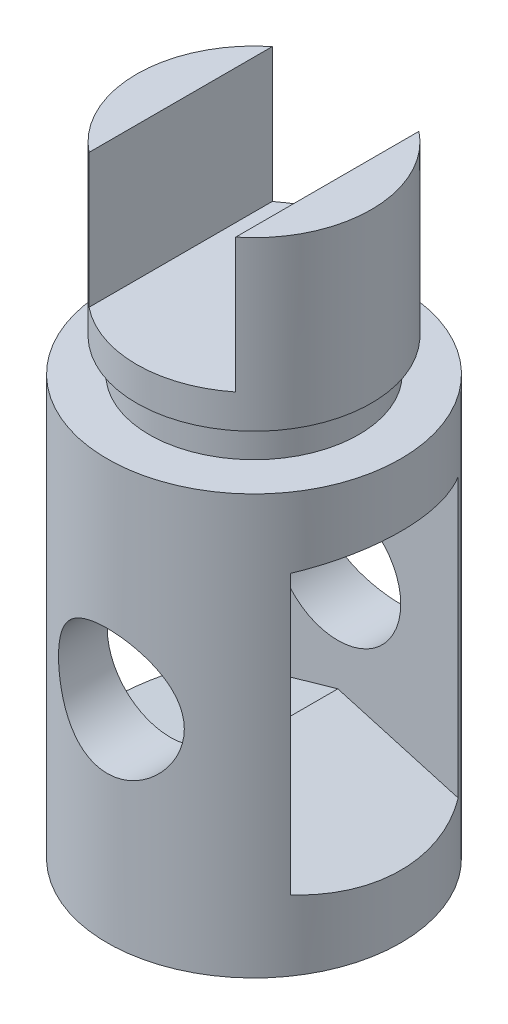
from build123d import *

# Parameters (mm, degrees)
CUT_EXTRUDE_1_DEPTH = 20
SKETCH_3_R          = 15
CUT_EXTRUDE_2_DEPTH = 50
SKETCH_4_W          = 35
SKETCH_4_H          = 76.64713395
CUT_EXTRUDE_3_DEPTH = 32


with BuildPart() as part:
    # Sketch 1 → Revolve 1 (revolve)
    with BuildSketch(Plane.XY):
        Polygon((0, -50), (-35, -50), (-35, 50), (-25, 50), (-25, 58), (-28, 58), (-28, 98), (0, 98), align=None)
    revolve(axis=Axis((0, 98, 0), (0, -1, 0)))

    # Sketch 2 → Cut-Extrude 1 (cut, symmetric)
    with BuildSketch(Plane.XY):
        Polygon((-35, 35), (0, 25), (35, 35), (35, -35), (0, -25), (-35, -35), align=None)
    extrude(amount=CUT_EXTRUDE_1_DEPTH, both=True, mode=Mode.SUBTRACT)

    # Sketch 3 → Cut-Extrude 2 (cut, symmetric)
    with BuildSketch(Plane.XY):
        Circle(SKETCH_3_R)
    extrude(amount=CUT_EXTRUDE_2_DEPTH, both=True, mode=Mode.SUBTRACT)

    # Sketch 4 → Cut-Extrude 3 (cut)
    with BuildSketch(Plane(origin=(0, 98, 0), x_dir=(1, 0, 0), z_dir=(0, 1, 0))):
        Rectangle(SKETCH_4_W, SKETCH_4_H)
    extrude(amount=-CUT_EXTRUDE_3_DEPTH, mode=Mode.SUBTRACT)


solid = part.part
